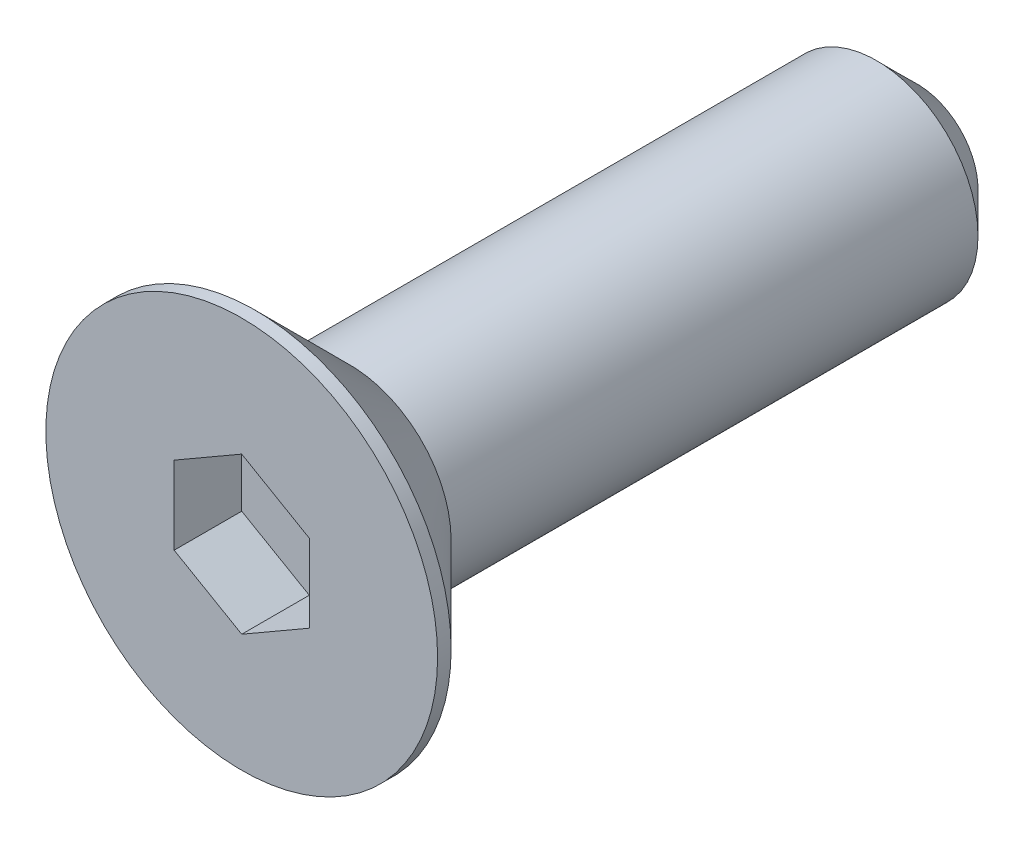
ISO-10303-21;
HEADER;
FILE_DESCRIPTION(('STEP AP214'),'2;1');
FILE_NAME('part.step','',(''),(''),'','','');
FILE_SCHEMA(('AUTOMOTIVE_DESIGN { 1 0 10303 214 1 1 1 1 }'));
ENDSEC;
DATA;
#1=APPLICATION_CONTEXT('core data for automotive mechanical design processes');
#2=APPLICATION_PROTOCOL_DEFINITION('international standard','automotive_design',2000,#1);
#3=PRODUCT_CONTEXT('',#1,'mechanical');
#4=PRODUCT('Part','Part','',(#3));
#5=PRODUCT_RELATED_PRODUCT_CATEGORY('part','',(#4));
#6=PRODUCT_DEFINITION_FORMATION('','',#4);
#7=PRODUCT_DEFINITION_CONTEXT('part definition',#1,'design');
#8=PRODUCT_DEFINITION('design','',#6,#7);
#9=PRODUCT_DEFINITION_SHAPE('','',#8);
#10=(LENGTH_UNIT() NAMED_UNIT(*) SI_UNIT(.MILLI.,.METRE.));
#11=(NAMED_UNIT(*) PLANE_ANGLE_UNIT() SI_UNIT($,.RADIAN.));
#12=(NAMED_UNIT(*) SI_UNIT($,.STERADIAN.) SOLID_ANGLE_UNIT());
#13=UNCERTAINTY_MEASURE_WITH_UNIT(LENGTH_MEASURE(1.E-05),#10,'distance_accuracy_value','');
#14=(GEOMETRIC_REPRESENTATION_CONTEXT(3) GLOBAL_UNCERTAINTY_ASSIGNED_CONTEXT((#13)) GLOBAL_UNIT_ASSIGNED_CONTEXT((#10,
#11,#12)) REPRESENTATION_CONTEXT('',''));
#15=CARTESIAN_POINT('',(0.,0.,0.));
#16=DIRECTION('',(0.,0.,1.));
#17=DIRECTION('',(1.,0.,0.));
#18=AXIS2_PLACEMENT_3D('',#15,#16,#17);
#19=CARTESIAN_POINT('',(0.,0.,0.));
#20=DIRECTION('',(0.,0.,1.));
#21=DIRECTION('',(1.,0.,0.));
#22=AXIS2_PLACEMENT_3D('',#19,#20,#21);
#23=PLANE('',#22);
#24=DIRECTION('',(0.866025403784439,-0.5,0.));
#25=VECTOR('',#24,1.);
#26=CARTESIAN_POINT('',(-1.,-0.577350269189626,0.));
#27=LINE('',#26,#25);
#28=CARTESIAN_POINT('',(-1.,-0.577350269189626,0.));
#29=VERTEX_POINT('',#28);
#30=CARTESIAN_POINT('',(0.,-1.15470053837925,0.));
#31=VERTEX_POINT('',#30);
#32=EDGE_CURVE('E29',#29,#31,#27,.T.);
#33=ORIENTED_EDGE('',*,*,#32,.F.);
#34=DIRECTION('',(0.,-1.,0.));
#35=VECTOR('',#34,1.);
#36=CARTESIAN_POINT('',(-1.,0.577350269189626,0.));
#37=LINE('',#36,#35);
#38=CARTESIAN_POINT('',(-1.,0.577350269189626,0.));
#39=VERTEX_POINT('',#38);
#40=EDGE_CURVE('E98',#39,#29,#37,.T.);
#41=ORIENTED_EDGE('',*,*,#40,.F.);
#42=DIRECTION('',(-0.866025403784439,-0.5,0.));
#43=VECTOR('',#42,1.);
#44=CARTESIAN_POINT('',(0.,1.15470053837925,0.));
#45=LINE('',#44,#43);
#46=CARTESIAN_POINT('',(0.,1.15470053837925,0.));
#47=VERTEX_POINT('',#46);
#48=EDGE_CURVE('E92',#47,#39,#45,.T.);
#49=ORIENTED_EDGE('',*,*,#48,.F.);
#50=DIRECTION('',(-0.866025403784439,0.5,0.));
#51=VECTOR('',#50,1.);
#52=CARTESIAN_POINT('',(1.,0.577350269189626,0.));
#53=LINE('',#52,#51);
#54=CARTESIAN_POINT('',(1.,0.577350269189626,0.));
#55=VERTEX_POINT('',#54);
#56=EDGE_CURVE('E90',#55,#47,#53,.T.);
#57=ORIENTED_EDGE('',*,*,#56,.F.);
#58=DIRECTION('',(0.,1.,0.));
#59=VECTOR('',#58,1.);
#60=CARTESIAN_POINT('',(1.,-0.577350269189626,0.));
#61=LINE('',#60,#59);
#62=CARTESIAN_POINT('',(1.,-0.577350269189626,0.));
#63=VERTEX_POINT('',#62);
#64=EDGE_CURVE('E72',#63,#55,#61,.T.);
#65=ORIENTED_EDGE('',*,*,#64,.F.);
#66=DIRECTION('',(0.866025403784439,0.5,0.));
#67=VECTOR('',#66,1.);
#68=CARTESIAN_POINT('',(0.,-1.15470053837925,0.));
#69=LINE('',#68,#67);
#70=EDGE_CURVE('E83',#31,#63,#69,.T.);
#71=ORIENTED_EDGE('',*,*,#70,.F.);
#72=EDGE_LOOP('',(#33,#41,#49,#57,#65,#71));
#73=FACE_BOUND('',#72,.T.);
#74=CARTESIAN_POINT('',(0.,0.,0.));
#75=DIRECTION('',(0.,0.,1.));
#76=DIRECTION('',(1.,0.,0.));
#77=AXIS2_PLACEMENT_3D('',#74,#75,#76);
#78=CIRCLE('',#77,2.9);
#79=CARTESIAN_POINT('',(2.9,0.,0.));
#80=VERTEX_POINT('',#79);
#81=EDGE_CURVE('E128',#80,#80,#78,.T.);
#82=ORIENTED_EDGE('',*,*,#81,.T.);
#83=EDGE_LOOP('',(#82));
#84=FACE_BOUND('',#83,.T.);
#85=ADVANCED_FACE('F14',(#73,#84),#23,.T.);
#86=CARTESIAN_POINT('',(0.,0.,6.05968084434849));
#87=DIRECTION('',(0.,0.,1.));
#88=DIRECTION('',(1.,0.,0.));
#89=AXIS2_PLACEMENT_3D('',#86,#87,#88);
#90=CYLINDRICAL_SURFACE('',#89,2.9);
#91=CARTESIAN_POINT('',(0.,0.,-0.2));
#92=DIRECTION('',(0.,0.,1.));
#93=DIRECTION('',(1.,0.,0.));
#94=AXIS2_PLACEMENT_3D('',#91,#92,#93);
#95=CIRCLE('',#94,2.9);
#96=CARTESIAN_POINT('',(2.9,0.,-0.2));
#97=VERTEX_POINT('',#96);
#98=EDGE_CURVE('E125',#97,#97,#95,.T.);
#99=ORIENTED_EDGE('',*,*,#98,.T.);
#100=EDGE_LOOP('',(#99));
#101=FACE_BOUND('',#100,.T.);
#102=ORIENTED_EDGE('',*,*,#81,.F.);
#103=EDGE_LOOP('',(#102));
#104=FACE_BOUND('',#103,.T.);
#105=ADVANCED_FACE('F148',(#101,#104),#90,.T.);
#106=CARTESIAN_POINT('',(0.,0.,-0.2));
#107=DIRECTION('',(0.,0.,1.));
#108=DIRECTION('',(1.,0.,0.));
#109=AXIS2_PLACEMENT_3D('',#106,#107,#108);
#110=CONICAL_SURFACE('',#109,2.9,0.78539816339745);
#111=CARTESIAN_POINT('',(0.,0.,-1.6));
#112=DIRECTION('',(0.,0.,1.));
#113=DIRECTION('',(1.,0.,0.));
#114=AXIS2_PLACEMENT_3D('',#111,#112,#113);
#115=CIRCLE('',#114,1.5);
#116=CARTESIAN_POINT('',(1.5,0.,-1.6));
#117=VERTEX_POINT('',#116);
#118=EDGE_CURVE('E116',#117,#117,#115,.T.);
#119=ORIENTED_EDGE('',*,*,#118,.T.);
#120=EDGE_LOOP('',(#119));
#121=FACE_BOUND('',#120,.T.);
#122=ORIENTED_EDGE('',*,*,#98,.F.);
#123=EDGE_LOOP('',(#122));
#124=FACE_BOUND('',#123,.T.);
#125=ADVANCED_FACE('F153',(#121,#124),#110,.T.);
#126=CARTESIAN_POINT('',(0.,0.,6.05968084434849));
#127=DIRECTION('',(0.,0.,1.));
#128=DIRECTION('',(1.,0.,0.));
#129=AXIS2_PLACEMENT_3D('',#126,#127,#128);
#130=CYLINDRICAL_SURFACE('',#129,1.5);
#131=CARTESIAN_POINT('',(0.,0.,-9.4));
#132=DIRECTION('',(0.,0.,-1.));
#133=DIRECTION('',(-1.,0.,0.));
#134=AXIS2_PLACEMENT_3D('',#131,#132,#133);
#135=CIRCLE('',#134,1.5);
#136=CARTESIAN_POINT('',(-1.5,0.,-9.4));
#137=VERTEX_POINT('',#136);
#138=EDGE_CURVE('E22',#137,#137,#135,.F.);
#139=ORIENTED_EDGE('',*,*,#138,.T.);
#140=EDGE_LOOP('',(#139));
#141=FACE_BOUND('',#140,.T.);
#142=ORIENTED_EDGE('',*,*,#118,.F.);
#143=EDGE_LOOP('',(#142));
#144=FACE_BOUND('',#143,.T.);
#145=ADVANCED_FACE('F133',(#141,#144),#130,.T.);
#146=CARTESIAN_POINT('',(1.5,0.,-10.));
#147=DIRECTION('',(0.,0.,-1.));
#148=DIRECTION('',(-1.,0.,0.));
#149=AXIS2_PLACEMENT_3D('',#146,#147,#148);
#150=PLANE('',#149);
#151=CARTESIAN_POINT('',(0.,0.,-10.));
#152=DIRECTION('',(0.,0.,-1.));
#153=DIRECTION('',(-1.,0.,0.));
#154=AXIS2_PLACEMENT_3D('',#151,#152,#153);
#155=CIRCLE('',#154,0.9);
#156=CARTESIAN_POINT('',(-0.9,0.,-10.));
#157=VERTEX_POINT('',#156);
#158=EDGE_CURVE('E9',#157,#157,#155,.T.);
#159=ORIENTED_EDGE('',*,*,#158,.T.);
#160=EDGE_LOOP('',(#159));
#161=FACE_BOUND('',#160,.T.);
#162=ADVANCED_FACE('F162',(#161),#150,.T.);
#163=CARTESIAN_POINT('',(-1.,-0.577350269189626,-1.));
#164=DIRECTION('',(-0.5,-0.866025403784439,0.));
#165=DIRECTION('',(0.866025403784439,-0.5,0.));
#166=AXIS2_PLACEMENT_3D('',#163,#164,#165);
#167=PLANE('',#166);
#168=ORIENTED_EDGE('',*,*,#32,.T.);
#169=DIRECTION('',(0.,0.,1.));
#170=VECTOR('',#169,1.);
#171=CARTESIAN_POINT('',(0.,-1.15470053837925,-1.));
#172=LINE('',#171,#170);
#173=CARTESIAN_POINT('',(0.,-1.15470053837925,-1.));
#174=VERTEX_POINT('',#173);
#175=EDGE_CURVE('E80',#174,#31,#172,.T.);
#176=ORIENTED_EDGE('',*,*,#175,.F.);
#177=DIRECTION('',(0.866025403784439,-0.5,0.));
#178=VECTOR('',#177,1.);
#179=CARTESIAN_POINT('',(-1.,-0.577350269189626,-1.));
#180=LINE('',#179,#178);
#181=CARTESIAN_POINT('',(-1.,-0.577350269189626,-1.));
#182=VERTEX_POINT('',#181);
#183=EDGE_CURVE('E100',#182,#174,#180,.T.);
#184=ORIENTED_EDGE('',*,*,#183,.F.);
#185=DIRECTION('',(0.,0.,1.));
#186=VECTOR('',#185,1.);
#187=CARTESIAN_POINT('',(-1.,-0.577350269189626,-1.));
#188=LINE('',#187,#186);
#189=EDGE_CURVE('E36',#182,#29,#188,.T.);
#190=ORIENTED_EDGE('',*,*,#189,.T.);
#191=EDGE_LOOP('',(#168,#176,#184,#190));
#192=FACE_BOUND('',#191,.T.);
#193=ADVANCED_FACE('F165',(#192),#167,.F.);
#194=CARTESIAN_POINT('',(-1.,0.577350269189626,-1.));
#195=DIRECTION('',(-1.,0.,0.));
#196=DIRECTION('',(0.,0.,1.));
#197=AXIS2_PLACEMENT_3D('',#194,#195,#196);
#198=PLANE('',#197);
#199=ORIENTED_EDGE('',*,*,#40,.T.);
#200=ORIENTED_EDGE('',*,*,#189,.F.);
#201=DIRECTION('',(0.,-1.,0.));
#202=VECTOR('',#201,1.);
#203=CARTESIAN_POINT('',(-1.,0.577350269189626,-1.));
#204=LINE('',#203,#202);
#205=CARTESIAN_POINT('',(-1.,0.577350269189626,-1.));
#206=VERTEX_POINT('',#205);
#207=EDGE_CURVE('E112',#206,#182,#204,.T.);
#208=ORIENTED_EDGE('',*,*,#207,.F.);
#209=DIRECTION('',(0.,0.,1.));
#210=VECTOR('',#209,1.);
#211=CARTESIAN_POINT('',(-1.,0.577350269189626,-1.));
#212=LINE('',#211,#210);
#213=EDGE_CURVE('E117',#206,#39,#212,.T.);
#214=ORIENTED_EDGE('',*,*,#213,.T.);
#215=EDGE_LOOP('',(#199,#200,#208,#214));
#216=FACE_BOUND('',#215,.T.);
#217=ADVANCED_FACE('F169',(#216),#198,.F.);
#218=CARTESIAN_POINT('',(0.,1.15470053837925,-1.));
#219=DIRECTION('',(-0.5,0.866025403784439,0.));
#220=DIRECTION('',(-0.866025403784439,-0.5,0.));
#221=AXIS2_PLACEMENT_3D('',#218,#219,#220);
#222=PLANE('',#221);
#223=ORIENTED_EDGE('',*,*,#48,.T.);
#224=ORIENTED_EDGE('',*,*,#213,.F.);
#225=DIRECTION('',(-0.866025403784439,-0.5,0.));
#226=VECTOR('',#225,1.);
#227=CARTESIAN_POINT('',(0.,1.15470053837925,-1.));
#228=LINE('',#227,#226);
#229=CARTESIAN_POINT('',(0.,1.15470053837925,-1.));
#230=VERTEX_POINT('',#229);
#231=EDGE_CURVE('E109',#230,#206,#228,.T.);
#232=ORIENTED_EDGE('',*,*,#231,.F.);
#233=DIRECTION('',(0.,0.,1.));
#234=VECTOR('',#233,1.);
#235=CARTESIAN_POINT('',(0.,1.15470053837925,-1.));
#236=LINE('',#235,#234);
#237=EDGE_CURVE('E119',#230,#47,#236,.T.);
#238=ORIENTED_EDGE('',*,*,#237,.T.);
#239=EDGE_LOOP('',(#223,#224,#232,#238));
#240=FACE_BOUND('',#239,.T.);
#241=ADVANCED_FACE('F177',(#240),#222,.F.);
#242=CARTESIAN_POINT('',(1.,0.577350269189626,-1.));
#243=DIRECTION('',(0.5,0.866025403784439,0.));
#244=DIRECTION('',(-0.866025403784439,0.5,0.));
#245=AXIS2_PLACEMENT_3D('',#242,#243,#244);
#246=PLANE('',#245);
#247=ORIENTED_EDGE('',*,*,#56,.T.);
#248=ORIENTED_EDGE('',*,*,#237,.F.);
#249=DIRECTION('',(-0.866025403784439,0.5,0.));
#250=VECTOR('',#249,1.);
#251=CARTESIAN_POINT('',(1.,0.577350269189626,-1.));
#252=LINE('',#251,#250);
#253=CARTESIAN_POINT('',(1.,0.577350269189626,-1.));
#254=VERTEX_POINT('',#253);
#255=EDGE_CURVE('E106',#254,#230,#252,.T.);
#256=ORIENTED_EDGE('',*,*,#255,.F.);
#257=DIRECTION('',(0.,0.,1.));
#258=VECTOR('',#257,1.);
#259=CARTESIAN_POINT('',(1.,0.577350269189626,-1.));
#260=LINE('',#259,#258);
#261=EDGE_CURVE('E79',#254,#55,#260,.T.);
#262=ORIENTED_EDGE('',*,*,#261,.T.);
#263=EDGE_LOOP('',(#247,#248,#256,#262));
#264=FACE_BOUND('',#263,.T.);
#265=ADVANCED_FACE('F174',(#264),#246,.F.);
#266=CARTESIAN_POINT('',(1.,-0.577350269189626,-1.));
#267=DIRECTION('',(1.,0.,0.));
#268=DIRECTION('',(0.,0.,-1.));
#269=AXIS2_PLACEMENT_3D('',#266,#267,#268);
#270=PLANE('',#269);
#271=ORIENTED_EDGE('',*,*,#64,.T.);
#272=ORIENTED_EDGE('',*,*,#261,.F.);
#273=DIRECTION('',(0.,1.,0.));
#274=VECTOR('',#273,1.);
#275=CARTESIAN_POINT('',(1.,-0.577350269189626,-1.));
#276=LINE('',#275,#274);
#277=CARTESIAN_POINT('',(1.,-0.577350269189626,-1.));
#278=VERTEX_POINT('',#277);
#279=EDGE_CURVE('E75',#278,#254,#276,.T.);
#280=ORIENTED_EDGE('',*,*,#279,.F.);
#281=DIRECTION('',(0.,0.,1.));
#282=VECTOR('',#281,1.);
#283=CARTESIAN_POINT('',(1.,-0.577350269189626,-1.));
#284=LINE('',#283,#282);
#285=EDGE_CURVE('E68',#278,#63,#284,.T.);
#286=ORIENTED_EDGE('',*,*,#285,.T.);
#287=EDGE_LOOP('',(#271,#272,#280,#286));
#288=FACE_BOUND('',#287,.T.);
#289=ADVANCED_FACE('F70',(#288),#270,.F.);
#290=CARTESIAN_POINT('',(0.,-1.15470053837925,-1.));
#291=DIRECTION('',(0.5,-0.866025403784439,0.));
#292=DIRECTION('',(0.866025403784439,0.5,0.));
#293=AXIS2_PLACEMENT_3D('',#290,#291,#292);
#294=PLANE('',#293);
#295=ORIENTED_EDGE('',*,*,#70,.T.);
#296=ORIENTED_EDGE('',*,*,#285,.F.);
#297=DIRECTION('',(0.866025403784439,0.5,0.));
#298=VECTOR('',#297,1.);
#299=CARTESIAN_POINT('',(0.,-1.15470053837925,-1.));
#300=LINE('',#299,#298);
#301=EDGE_CURVE('E103',#174,#278,#300,.T.);
#302=ORIENTED_EDGE('',*,*,#301,.F.);
#303=ORIENTED_EDGE('',*,*,#175,.T.);
#304=EDGE_LOOP('',(#295,#296,#302,#303));
#305=FACE_BOUND('',#304,.T.);
#306=ADVANCED_FACE('F84',(#305),#294,.F.);
#307=CARTESIAN_POINT('',(0.,-1.15470053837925,-1.));
#308=DIRECTION('',(0.,0.,1.));
#309=DIRECTION('',(1.,0.,0.));
#310=AXIS2_PLACEMENT_3D('',#307,#308,#309);
#311=PLANE('',#310);
#312=ORIENTED_EDGE('',*,*,#183,.T.);
#313=ORIENTED_EDGE('',*,*,#301,.T.);
#314=ORIENTED_EDGE('',*,*,#279,.T.);
#315=ORIENTED_EDGE('',*,*,#255,.T.);
#316=ORIENTED_EDGE('',*,*,#231,.T.);
#317=ORIENTED_EDGE('',*,*,#207,.T.);
#318=EDGE_LOOP('',(#312,#313,#314,#315,#316,#317));
#319=FACE_BOUND('',#318,.T.);
#320=ADVANCED_FACE('F137',(#319),#311,.T.);
#321=CARTESIAN_POINT('',(0.,0.,-9.4));
#322=DIRECTION('',(0.,0.,1.));
#323=DIRECTION('',(1.,0.,0.));
#324=AXIS2_PLACEMENT_3D('',#321,#322,#323);
#325=CONICAL_SURFACE('',#324,1.5,0.78539816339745);
#326=ORIENTED_EDGE('',*,*,#158,.F.);
#327=EDGE_LOOP('',(#326));
#328=FACE_BOUND('',#327,.T.);
#329=ORIENTED_EDGE('',*,*,#138,.F.);
#330=EDGE_LOOP('',(#329));
#331=FACE_BOUND('',#330,.T.);
#332=ADVANCED_FACE('F16',(#328,#331),#325,.T.);
#333=CLOSED_SHELL('',(#85,#105,#125,#145,#162,#193,#217,#241,#265,#289,#306,#320,#332));
#334=MANIFOLD_SOLID_BREP('B1',#333);
#335=ADVANCED_BREP_SHAPE_REPRESENTATION('',(#18,#334),#14);
#336=SHAPE_DEFINITION_REPRESENTATION(#9,#335);
ENDSEC;
END-ISO-10303-21;
